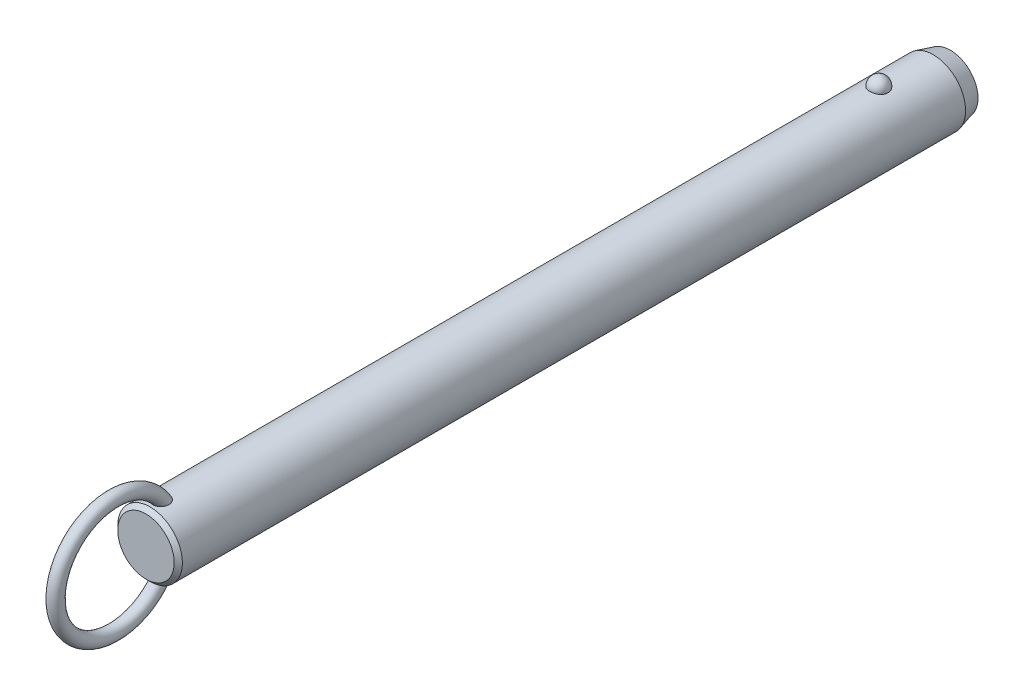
ISO-10303-21;
HEADER;
FILE_DESCRIPTION(('STEP AP214'),'2;1');
FILE_NAME('part.step','',(''),(''),'','','');
FILE_SCHEMA(('AUTOMOTIVE_DESIGN { 1 0 10303 214 1 1 1 1 }'));
ENDSEC;
DATA;
#1=APPLICATION_CONTEXT('core data for automotive mechanical design processes');
#2=APPLICATION_PROTOCOL_DEFINITION('international standard','automotive_design',2000,#1);
#3=PRODUCT_CONTEXT('',#1,'mechanical');
#4=PRODUCT('Part','Part','',(#3));
#5=PRODUCT_RELATED_PRODUCT_CATEGORY('part','',(#4));
#6=PRODUCT_DEFINITION_FORMATION('','',#4);
#7=PRODUCT_DEFINITION_CONTEXT('part definition',#1,'design');
#8=PRODUCT_DEFINITION('design','',#6,#7);
#9=PRODUCT_DEFINITION_SHAPE('','',#8);
#10=(LENGTH_UNIT() NAMED_UNIT(*) SI_UNIT(.MILLI.,.METRE.));
#11=(NAMED_UNIT(*) PLANE_ANGLE_UNIT() SI_UNIT($,.RADIAN.));
#12=(NAMED_UNIT(*) SI_UNIT($,.STERADIAN.) SOLID_ANGLE_UNIT());
#13=UNCERTAINTY_MEASURE_WITH_UNIT(LENGTH_MEASURE(1.E-05),#10,'distance_accuracy_value','');
#14=(GEOMETRIC_REPRESENTATION_CONTEXT(3) GLOBAL_UNCERTAINTY_ASSIGNED_CONTEXT((#13)) GLOBAL_UNIT_ASSIGNED_CONTEXT((#10,
#11,#12)) REPRESENTATION_CONTEXT('',''));
#15=CARTESIAN_POINT('',(0.,0.,0.));
#16=DIRECTION('',(0.,0.,1.));
#17=DIRECTION('',(1.,0.,0.));
#18=AXIS2_PLACEMENT_3D('',#15,#16,#17);
#19=CARTESIAN_POINT('',(0.,0.,203.2));
#20=DIRECTION('',(0.,0.,-1.));
#21=DIRECTION('',(-1.,0.,0.));
#22=AXIS2_PLACEMENT_3D('',#19,#20,#21);
#23=CYLINDRICAL_SURFACE('',#22,9.5);
#24=CARTESIAN_POINT('',(2.67259918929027,9.11631578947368,-2.70000000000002));
#25=CARTESIAN_POINT('',(2.6725968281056,9.11631786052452,-2.54909854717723));
#26=CARTESIAN_POINT('',(2.66030567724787,9.11994722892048,-2.39816735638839));
#27=CARTESIAN_POINT('',(2.6114347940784,9.13405924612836,-2.10058568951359));
#28=CARTESIAN_POINT('',(2.57484658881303,9.14454428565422,-1.95393672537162));
#29=CARTESIAN_POINT('',(2.47830875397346,9.17117631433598,-1.66916069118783));
#30=CARTESIAN_POINT('',(2.41836936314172,9.18732082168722,-1.53102991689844));
#31=CARTESIAN_POINT('',(2.27661331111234,9.22346780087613,-1.26705393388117));
#32=CARTESIAN_POINT('',(2.19479699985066,9.24347021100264,-1.14120852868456));
#33=CARTESIAN_POINT('',(2.01085282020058,9.28522401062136,-0.904632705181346));
#34=CARTESIAN_POINT('',(1.90862396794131,9.30698376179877,-0.793982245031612));
#35=CARTESIAN_POINT('',(1.6867437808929,9.34973971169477,-0.591607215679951));
#36=CARTESIAN_POINT('',(1.56709244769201,9.37073591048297,-0.499882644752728));
#37=CARTESIAN_POINT('',(1.31393976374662,9.40956370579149,-0.338167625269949));
#38=CARTESIAN_POINT('',(1.18048026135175,9.42740444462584,-0.268113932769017));
#39=CARTESIAN_POINT('',(0.903154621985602,9.45799906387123,-0.151390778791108));
#40=CARTESIAN_POINT('',(0.759289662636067,9.47075351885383,-0.104718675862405));
#41=CARTESIAN_POINT('',(0.468074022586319,9.48956256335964,-0.0367633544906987));
#42=CARTESIAN_POINT('',(0.320836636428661,9.49573643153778,-0.015027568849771));
#43=CARTESIAN_POINT('',(0.0246714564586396,9.50112183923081,0.00396199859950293));
#44=CARTESIAN_POINT('',(-0.124256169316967,9.50033406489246,0.00121819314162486));
#45=CARTESIAN_POINT('',(-0.417264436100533,9.4919475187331,-0.0284441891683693));
#46=CARTESIAN_POINT('',(-0.561384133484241,9.48444885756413,-0.0550074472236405));
#47=CARTESIAN_POINT('',(-0.842986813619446,9.46357853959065,-0.131064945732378));
#48=CARTESIAN_POINT('',(-0.98046968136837,9.450206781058,-0.180559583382));
#49=CARTESIAN_POINT('',(-1.24585005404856,9.41890822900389,-0.301476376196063));
#50=CARTESIAN_POINT('',(-1.37368611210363,9.40095498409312,-0.373026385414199));
#51=CARTESIAN_POINT('',(-1.61552738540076,9.3624296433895,-0.536025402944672));
#52=CARTESIAN_POINT('',(-1.72953116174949,9.34185727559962,-0.627476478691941));
#53=CARTESIAN_POINT('',(-1.9429225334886,9.29984568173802,-0.829844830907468));
#54=CARTESIAN_POINT('',(-2.04198021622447,9.27839736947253,-0.941108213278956));
#55=CARTESIAN_POINT('',(-2.2202646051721,9.23735994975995,-1.17883414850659));
#56=CARTESIAN_POINT('',(-2.29948985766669,9.21777097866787,-1.30529781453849));
#57=CARTESIAN_POINT('',(-2.43697287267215,9.18238994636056,-1.57158566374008));
#58=CARTESIAN_POINT('',(-2.49497068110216,9.16664569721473,-1.71155057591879));
#59=CARTESIAN_POINT('',(-2.5872073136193,9.14104303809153,-1.99961197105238));
#60=CARTESIAN_POINT('',(-2.62144683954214,9.13118445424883,-2.1477082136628));
#61=CARTESIAN_POINT('',(-2.66521466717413,9.11850622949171,-2.44715424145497));
#62=CARTESIAN_POINT('',(-2.67484831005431,9.11565658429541,-2.59848735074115));
#63=CARTESIAN_POINT('',(-2.66946735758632,9.11723375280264,-2.90067317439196));
#64=CARTESIAN_POINT('',(-2.65445345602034,9.12166036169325,-3.05152590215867));
#65=CARTESIAN_POINT('',(-2.6002971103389,9.13724422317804,-3.34766110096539));
#66=CARTESIAN_POINT('',(-2.56127978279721,9.14836656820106,-3.49296833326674));
#67=CARTESIAN_POINT('',(-2.46018844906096,9.17606676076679,-3.77477535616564));
#68=CARTESIAN_POINT('',(-2.39811349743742,9.19264483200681,-3.91127478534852));
#69=CARTESIAN_POINT('',(-2.25202303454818,9.22952198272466,-4.17244273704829));
#70=CARTESIAN_POINT('',(-2.16788714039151,9.24984129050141,-4.29704106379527));
#71=CARTESIAN_POINT('',(-1.9799408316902,9.29188255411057,-4.53013066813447));
#72=CARTESIAN_POINT('',(-1.87612963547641,9.31360456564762,-4.63862130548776));
#73=CARTESIAN_POINT('',(-1.65105429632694,9.35612959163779,-4.83690299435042));
#74=CARTESIAN_POINT('',(-1.52972405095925,9.37692871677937,-4.9266199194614));
#75=CARTESIAN_POINT('',(-1.27318250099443,9.41518970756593,-5.08429106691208));
#76=CARTESIAN_POINT('',(-1.13797219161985,9.432651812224,-5.15224684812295));
#77=CARTESIAN_POINT('',(-0.859280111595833,9.46208255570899,-5.26371827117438));
#78=CARTESIAN_POINT('',(-0.715925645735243,9.47411833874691,-5.30753421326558));
#79=CARTESIAN_POINT('',(-0.423550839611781,9.4916822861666,-5.37076321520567));
#80=CARTESIAN_POINT('',(-0.274531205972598,9.49721125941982,-5.39017930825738));
#81=CARTESIAN_POINT('',(0.0218446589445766,9.50110860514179,-5.40390587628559));
#82=CARTESIAN_POINT('',(0.169177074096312,9.49961381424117,-5.39869609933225));
#83=CARTESIAN_POINT('',(0.460808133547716,9.48993906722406,-5.36441955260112));
#84=CARTESIAN_POINT('',(0.605106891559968,9.48175936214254,-5.33535367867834));
#85=CARTESIAN_POINT('',(0.886027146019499,9.4596376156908,-5.25435587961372));
#86=CARTESIAN_POINT('',(1.02267710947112,9.44571881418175,-5.20251612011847));
#87=CARTESIAN_POINT('',(1.28523827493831,9.41358993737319,-5.07741549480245));
#88=CARTESIAN_POINT('',(1.41114877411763,9.39537958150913,-5.00415322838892));
#89=CARTESIAN_POINT('',(1.65085227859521,9.3562644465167,-4.83684599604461));
#90=CARTESIAN_POINT('',(1.76442346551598,9.33532178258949,-4.74249218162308));
#91=CARTESIAN_POINT('',(1.97425672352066,9.29321198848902,-4.53620389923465));
#92=CARTESIAN_POINT('',(2.07051582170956,9.27204482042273,-4.42426641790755));
#93=CARTESIAN_POINT('',(2.24490086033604,9.23139221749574,-4.18363183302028));
#94=CARTESIAN_POINT('',(2.32267019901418,9.21194380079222,-4.05466990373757));
#95=CARTESIAN_POINT('',(2.45584092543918,9.1773419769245,-3.78517836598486));
#96=CARTESIAN_POINT('',(2.51124979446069,9.16218713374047,-3.644652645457));
#97=CARTESIAN_POINT('',(2.59380876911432,9.13913522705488,-3.37104301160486));
#98=CARTESIAN_POINT('',(2.62330266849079,9.13064624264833,-3.23871053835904));
#99=CARTESIAN_POINT('',(2.66269870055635,9.11923566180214,-2.97092664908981));
#100=CARTESIAN_POINT('',(2.67260130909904,9.11631393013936,-2.83547530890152));
#101=CARTESIAN_POINT('',(2.67259918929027,9.11631578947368,-2.70000000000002));
#102=B_SPLINE_CURVE_WITH_KNOTS('',3,(#24,#25,#26,#27,#28,#29,#30,#31,#32,#33,#34,#35,#36,#37,
#38,#39,#40,#41,#42,#43,#44,#45,#46,#47,#48,#49,#50,#51,#52,#53,#54,#55,#56,#57,#58,#59,#60,#61,
#62,#63,#64,#65,#66,#67,#68,#69,#70,#71,#72,#73,#74,#75,#76,#77,#78,#79,#80,#81,#82,#83,#84,#85,
#86,#87,#88,#89,#90,#91,#92,#93,#94,#95,#96,#97,#98,#99,#100,#101),.UNSPECIFIED.,.T.,.F.,(4,2,2,
2,2,2,2,2,2,2,2,2,2,2,2,2,2,2,2,2,2,2,2,2,2,2,2,2,2,2,2,2,2,2,2,2,2,2,4),(0.,0.452217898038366,
0.904593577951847,1.35677112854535,1.80894144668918,2.26340676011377,2.71787203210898,
3.17099820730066,3.62407318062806,4.0687883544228,4.51345969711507,4.95160616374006,
5.38976021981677,5.83050358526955,6.27129275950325,6.72071308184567,7.17016633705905,
7.62495278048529,8.07972578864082,8.53254856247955,8.98535859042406,9.43582813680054,
9.88631615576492,10.3393155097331,10.7923328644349,11.2471065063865,11.7018475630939,
12.1507959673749,12.5996885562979,13.0398725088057,13.4800399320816,13.9184421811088,
14.3568730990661,14.802202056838,15.2476074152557,15.7010097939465,16.1542603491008,
16.5602594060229,16.9662486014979),.UNSPECIFIED.);
#103=CARTESIAN_POINT('',(2.67259918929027,9.11631578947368,-2.70000000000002));
#104=VERTEX_POINT('',#103);
#105=EDGE_CURVE('E41',#104,#104,#102,.T.);
#106=ORIENTED_EDGE('',*,*,#105,.T.);
#107=EDGE_LOOP('',(#106));
#108=FACE_BOUND('',#107,.T.);
#109=CARTESIAN_POINT('',(0.,0.,211.52));
#110=DIRECTION('',(0.,0.,1.));
#111=DIRECTION('',(1.,0.,0.));
#112=AXIS2_PLACEMENT_3D('',#109,#110,#111);
#113=CIRCLE('',#112,9.5);
#114=CARTESIAN_POINT('',(9.5,0.,211.52));
#115=VERTEX_POINT('',#114);
#116=EDGE_CURVE('E10',#115,#115,#113,.F.);
#117=ORIENTED_EDGE('',*,*,#116,.T.);
#118=EDGE_LOOP('',(#117));
#119=FACE_BOUND('',#118,.T.);
#120=CARTESIAN_POINT('',(-0.697062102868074,-9.47439269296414,205.867808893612));
#121=CARTESIAN_POINT('',(-0.799579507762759,-9.46685146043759,205.907482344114));
#122=CARTESIAN_POINT('',(-0.898575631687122,-9.45788043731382,205.9559309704));
#123=CARTESIAN_POINT('',(-1.08670047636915,-9.43811593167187,206.068868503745));
#124=CARTESIAN_POINT('',(-1.17583204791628,-9.42732297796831,206.133352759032));
#125=CARTESIAN_POINT('',(-1.34179806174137,-9.40513672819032,206.276209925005));
#126=CARTESIAN_POINT('',(-1.41865133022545,-9.39374438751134,206.354561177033));
#127=CARTESIAN_POINT('',(-1.5586004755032,-9.37154196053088,206.522752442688));
#128=CARTESIAN_POINT('',(-1.62169476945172,-9.3607319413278,206.61259377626));
#129=CARTESIAN_POINT('',(-1.73527695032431,-9.34035749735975,206.804500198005));
#130=CARTESIAN_POINT('',(-1.78522266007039,-9.33085270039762,206.906891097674));
#131=CARTESIAN_POINT('',(-1.86924997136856,-9.3143834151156,207.118148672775));
#132=CARTESIAN_POINT('',(-1.90332570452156,-9.30741986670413,207.227017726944));
#133=CARTESIAN_POINT('',(-1.95893603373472,-9.29588482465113,207.460473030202));
#134=CARTESIAN_POINT('',(-1.97872420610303,-9.29165182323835,207.585489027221));
#135=CARTESIAN_POINT('',(-2.00062129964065,-9.28695978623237,207.837080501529));
#136=CARTESIAN_POINT('',(-2.00272284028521,-9.28650232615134,207.963656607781));
#137=CARTESIAN_POINT('',(-1.98958876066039,-9.28932750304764,208.236815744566));
#138=CARTESIAN_POINT('',(-1.97143366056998,-9.2932400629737,208.383251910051));
#139=CARTESIAN_POINT('',(-1.91479925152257,-9.30507151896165,208.672062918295));
#140=CARTESIAN_POINT('',(-1.87629122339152,-9.31299607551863,208.814431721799));
#141=CARTESIAN_POINT('',(-1.77225683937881,-9.33340232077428,209.115172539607));
#142=CARTESIAN_POINT('',(-1.70334898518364,-9.34641636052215,209.272369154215));
#143=CARTESIAN_POINT('',(-1.58111062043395,-9.36759153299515,209.497517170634));
#144=CARTESIAN_POINT('',(-1.53721459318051,-9.37492619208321,209.570796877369));
#145=CARTESIAN_POINT('',(-1.44302631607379,-9.38988566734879,209.71307405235));
#146=CARTESIAN_POINT('',(-1.39273721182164,-9.39751033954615,209.782073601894));
#147=CARTESIAN_POINT('',(-1.26775962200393,-9.41530678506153,209.936983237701));
#148=CARTESIAN_POINT('',(-1.19052326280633,-9.42548108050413,210.020871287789));
#149=CARTESIAN_POINT('',(-1.02420241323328,-9.44499825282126,210.176008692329));
#150=CARTESIAN_POINT('',(-0.935139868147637,-9.45434261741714,210.247280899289));
#151=CARTESIAN_POINT('',(-0.766610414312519,-9.46930670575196,210.358695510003));
#152=CARTESIAN_POINT('',(-0.689439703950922,-9.47529223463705,210.402235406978));
#153=CARTESIAN_POINT('',(-0.528942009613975,-9.48560294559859,210.47631336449));
#154=CARTESIAN_POINT('',(-0.445620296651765,-9.48992953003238,210.506862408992));
#155=CARTESIAN_POINT('',(-0.273901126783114,-9.49644161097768,210.552579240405));
#156=CARTESIAN_POINT('',(-0.18546574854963,-9.49860811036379,210.56761059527));
#157=CARTESIAN_POINT('',(-0.00734541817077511,-9.5004135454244,210.580149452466));
#158=CARTESIAN_POINT('',(0.0823387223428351,-9.50005405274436,210.577667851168));
#159=CARTESIAN_POINT('',(0.247679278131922,-9.49708301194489,210.556995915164));
#160=CARTESIAN_POINT('',(0.323620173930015,-9.49477609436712,210.540930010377));
#161=CARTESIAN_POINT('',(0.471981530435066,-9.48855917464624,210.497172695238));
#162=CARTESIAN_POINT('',(0.544400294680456,-9.48464840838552,210.469475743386));
#163=CARTESIAN_POINT('',(0.708947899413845,-9.47398336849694,210.39280266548));
#164=CARTESIAN_POINT('',(0.79914966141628,-9.46671310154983,210.339774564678));
#165=CARTESIAN_POINT('',(0.969783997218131,-9.4507622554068,210.219973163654));
#166=CARTESIAN_POINT('',(1.05019415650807,-9.44207854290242,210.153169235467));
#167=CARTESIAN_POINT('',(1.23092343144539,-9.42051459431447,209.980759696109));
#168=CARTESIAN_POINT('',(1.32652499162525,-9.40733378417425,209.87026193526));
#169=CARTESIAN_POINT('',(1.49893121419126,-9.3814074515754,209.635561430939));
#170=CARTESIAN_POINT('',(1.5757161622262,-9.36866239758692,209.511344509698));
#171=CARTESIAN_POINT('',(1.71285426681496,-9.34457644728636,209.249389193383));
#172=CARTESIAN_POINT('',(1.77266365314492,-9.33328726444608,209.11136233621));
#173=CARTESIAN_POINT('',(1.87239208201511,-9.31379209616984,208.828051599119));
#174=CARTESIAN_POINT('',(1.91230158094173,-9.30558759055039,208.682764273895));
#175=CARTESIAN_POINT('',(1.97604189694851,-9.29228394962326,208.362028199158));
#176=CARTESIAN_POINT('',(1.99587438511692,-9.28797202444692,208.185724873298));
#177=CARTESIAN_POINT('',(2.0029570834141,-9.28645519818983,207.832414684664));
#178=CARTESIAN_POINT('',(1.99025930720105,-9.28923895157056,207.655409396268));
#179=CARTESIAN_POINT('',(1.93735479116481,-9.30038134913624,207.356338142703));
#180=CARTESIAN_POINT('',(1.90576827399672,-9.30697680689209,207.232667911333));
#181=CARTESIAN_POINT('',(1.82287484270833,-9.32356855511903,206.992329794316));
#182=CARTESIAN_POINT('',(1.77158213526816,-9.33356239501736,206.875656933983));
#183=CARTESIAN_POINT('',(1.64885744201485,-9.35602275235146,206.652706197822));
#184=CARTESIAN_POINT('',(1.57730995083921,-9.36850332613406,206.546492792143));
#185=CARTESIAN_POINT('',(1.41543264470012,-9.39431873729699,206.349553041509));
#186=CARTESIAN_POINT('',(1.32510883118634,-9.40765330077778,206.258821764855));
#187=CARTESIAN_POINT('',(1.13846223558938,-9.43195720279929,206.105033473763));
#188=CARTESIAN_POINT('',(1.04369890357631,-9.4430289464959,206.040094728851));
#189=CARTESIAN_POINT('',(0.843965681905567,-9.46296805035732,205.928038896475));
#190=CARTESIAN_POINT('',(0.739000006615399,-9.4718363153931,205.880914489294));
#191=CARTESIAN_POINT('',(0.52817529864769,-9.48586140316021,205.808117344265));
#192=CARTESIAN_POINT('',(0.422686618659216,-9.49119633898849,205.78140249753));
#193=CARTESIAN_POINT('',(0.208590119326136,-9.49831365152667,205.746013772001));
#194=CARTESIAN_POINT('',(0.0999817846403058,-9.500095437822,205.737342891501));
#195=CARTESIAN_POINT('',(-0.126104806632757,-9.49988861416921,205.738350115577));
#196=CARTESIAN_POINT('',(-0.243578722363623,-9.49757821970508,205.749594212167));
#197=CARTESIAN_POINT('',(-0.474390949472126,-9.48885165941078,205.793167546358));
#198=CARTESIAN_POINT('',(-0.587729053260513,-9.48243528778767,205.825497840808));
#199=CARTESIAN_POINT('',(-0.697062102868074,-9.47439269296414,205.867808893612));
#200=B_SPLINE_CURVE_WITH_KNOTS('',3,(#120,#121,#122,#123,#124,#125,#126,#127,#128,#129,#130,
#131,#132,#133,#134,#135,#136,#137,#138,#139,#140,#141,#142,#143,#144,#145,#146,#147,#148,#149,
#150,#151,#152,#153,#154,#155,#156,#157,#158,#159,#160,#161,#162,#163,#164,#165,#166,#167,#168,
#169,#170,#171,#172,#173,#174,#175,#176,#177,#178,#179,#180,#181,#182,#183,#184,#185,#186,#187,
#188,#189,#190,#191,#192,#193,#194,#195,#196,#197,#198,#199),.UNSPECIFIED.,.T.,.F.,(4,2,2,2,2,2,
2,2,2,2,2,2,2,2,2,2,2,2,2,2,2,2,2,2,2,2,2,2,2,2,2,2,2,2,2,2,2,2,2,4),(0.,0.330119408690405,
0.660143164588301,0.989655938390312,1.31920659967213,1.66074728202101,2.00241415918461,
2.38088696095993,2.75951768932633,3.20065679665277,3.64242004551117,4.15620996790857,
4.41314162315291,4.66994734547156,5.01228664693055,5.35399933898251,5.61943037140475,
5.884636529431,6.15215502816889,6.41950709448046,6.65144391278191,6.88349136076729,
7.19641200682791,7.51003602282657,7.94779711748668,8.3860149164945,8.83699707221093,
9.28819530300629,9.81778662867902,10.3465317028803,10.7284172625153,11.1100280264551,
11.4938603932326,11.8775702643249,12.2220189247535,12.5663259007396,12.8915939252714,
13.2169159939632,13.5689650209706,13.9210316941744),.UNSPECIFIED.);
#201=CARTESIAN_POINT('',(-0.697062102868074,-9.47439269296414,205.867808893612));
#202=VERTEX_POINT('',#201);
#203=EDGE_CURVE('E60',#202,#202,#200,.T.);
#204=ORIENTED_EDGE('',*,*,#203,.T.);
#205=EDGE_LOOP('',(#204));
#206=FACE_BOUND('',#205,.T.);
#207=CARTESIAN_POINT('',(-0.697062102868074,9.47439269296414,205.867808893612));
#208=CARTESIAN_POINT('',(-0.597792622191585,9.48169483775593,205.82939564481));
#209=CARTESIAN_POINT('',(-0.495106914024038,9.48766580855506,205.799168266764));
#210=CARTESIAN_POINT('',(-0.285876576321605,9.49627648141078,205.756032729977));
#211=CARTESIAN_POINT('',(-0.179324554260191,9.49890941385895,205.743159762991));
#212=CARTESIAN_POINT('',(0.0344157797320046,9.50053798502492,205.735166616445));
#213=CARTESIAN_POINT('',(0.141603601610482,9.49953613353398,205.740034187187));
#214=CARTESIAN_POINT('',(0.353563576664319,9.49401038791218,205.767365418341));
#215=CARTESIAN_POINT('',(0.458336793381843,9.48948807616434,205.78982117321));
#216=CARTESIAN_POINT('',(0.66249373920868,9.4774236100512,205.851671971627));
#217=CARTESIAN_POINT('',(0.761881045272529,9.46988348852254,205.891055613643));
#218=CARTESIAN_POINT('',(0.95260839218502,9.45260382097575,205.985634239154));
#219=CARTESIAN_POINT('',(1.04394806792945,9.44286417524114,206.040829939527));
#220=CARTESIAN_POINT('',(1.21712767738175,9.42211760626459,206.166066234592));
#221=CARTESIAN_POINT('',(1.29885671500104,9.41109835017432,206.236257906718));
#222=CARTESIAN_POINT('',(1.44978975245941,9.38903310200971,206.388980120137));
#223=CARTESIAN_POINT('',(1.51899278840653,9.37798710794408,206.471511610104));
#224=CARTESIAN_POINT('',(1.64602857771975,9.35654375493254,206.649776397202));
#225=CARTESIAN_POINT('',(1.70333052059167,9.34618688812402,206.745891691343));
#226=CARTESIAN_POINT('',(1.80259341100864,9.32755128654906,206.945897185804));
#227=CARTESIAN_POINT('',(1.84454942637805,9.31927322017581,207.049789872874));
#228=CARTESIAN_POINT('',(1.91637039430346,9.30478365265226,207.272213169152));
#229=CARTESIAN_POINT('',(1.944805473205,9.29882552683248,207.391219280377));
#230=CARTESIAN_POINT('',(1.98449865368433,9.29043398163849,207.632143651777));
#231=CARTESIAN_POINT('',(1.99574908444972,9.28800213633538,207.754063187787));
#232=CARTESIAN_POINT('',(2.00275141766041,9.28649645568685,208.016932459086));
#233=CARTESIAN_POINT('',(1.99588238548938,9.28799035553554,208.157952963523));
#234=CARTESIAN_POINT('',(1.96270559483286,9.29505517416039,208.437621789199));
#235=CARTESIAN_POINT('',(1.93637872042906,9.30063010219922,208.576267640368));
#236=CARTESIAN_POINT('',(1.85949176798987,9.31633564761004,208.872561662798));
#237=CARTESIAN_POINT('',(1.80549792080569,9.3270926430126,209.029290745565));
#238=CARTESIAN_POINT('',(1.67376869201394,9.3516306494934,209.332284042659));
#239=CARTESIAN_POINT('',(1.59603181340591,9.36541185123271,209.478547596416));
#240=CARTESIAN_POINT('',(1.4360277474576,9.39110706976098,209.725813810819));
#241=CARTESIAN_POINT('',(1.35831795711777,9.40278656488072,209.829791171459));
#242=CARTESIAN_POINT('',(1.18774483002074,9.42585025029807,210.024534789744));
#243=CARTESIAN_POINT('',(1.09490932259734,9.43723493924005,210.115324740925));
#244=CARTESIAN_POINT('',(0.921110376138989,9.45552616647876,210.25620334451));
#245=CARTESIAN_POINT('',(0.843738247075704,9.46281058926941,210.310656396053));
#246=CARTESIAN_POINT('',(0.681245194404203,9.47589120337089,210.406711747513));
#247=CARTESIAN_POINT('',(0.596135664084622,9.48168953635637,210.448332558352));
#248=CARTESIAN_POINT('',(0.433779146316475,9.49038144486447,210.510089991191));
#249=CARTESIAN_POINT('',(0.357459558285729,9.49359170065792,210.53260136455));
#250=CARTESIAN_POINT('',(0.202074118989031,9.49816761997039,210.564574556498));
#251=CARTESIAN_POINT('',(0.12301025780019,9.49953459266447,210.574045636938));
#252=CARTESIAN_POINT('',(-0.0357372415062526,9.50026497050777,210.579114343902));
#253=CARTESIAN_POINT('',(-0.11542180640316,9.49962433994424,210.574684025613));
#254=CARTESIAN_POINT('',(-0.27282370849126,9.49640854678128,210.552296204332));
#255=CARTESIAN_POINT('',(-0.350540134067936,9.4938325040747,210.534332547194));
#256=CARTESIAN_POINT('',(-0.500580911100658,9.4870946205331,210.486802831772));
#257=CARTESIAN_POINT('',(-0.57297929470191,9.48296359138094,210.457461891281));
#258=CARTESIAN_POINT('',(-0.712864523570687,9.47347609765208,210.389008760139));
#259=CARTESIAN_POINT('',(-0.780349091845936,9.4681190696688,210.349892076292));
#260=CARTESIAN_POINT('',(-0.94630921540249,9.45329720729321,210.239432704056));
#261=CARTESIAN_POINT('',(-1.04090230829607,9.44321512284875,210.162329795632));
#262=CARTESIAN_POINT('',(-1.21661929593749,9.42219227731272,209.99409718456));
#263=CARTESIAN_POINT('',(-1.29770519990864,9.41124921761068,209.902929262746));
#264=CARTESIAN_POINT('',(-1.47319646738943,9.38563439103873,209.676162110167));
#265=CARTESIAN_POINT('',(-1.56208878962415,9.37102009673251,209.536289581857));
#266=CARTESIAN_POINT('',(-1.71623987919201,9.34401559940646,209.243950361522));
#267=CARTESIAN_POINT('',(-1.78147866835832,9.33162728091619,209.091473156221));
#268=CARTESIAN_POINT('',(-1.88853837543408,9.31055541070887,208.775647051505));
#269=CARTESIAN_POINT('',(-1.92998995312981,9.30193076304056,208.612168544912));
#270=CARTESIAN_POINT('',(-1.98590726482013,9.29015757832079,208.280526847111));
#271=CARTESIAN_POINT('',(-2.00040705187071,9.2870021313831,208.112369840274));
#272=CARTESIAN_POINT('',(-1.99964701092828,9.28716218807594,207.805080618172));
#273=CARTESIAN_POINT('',(-1.98908145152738,9.28945704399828,207.665936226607));
#274=CARTESIAN_POINT('',(-1.94566294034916,9.29865169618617,207.391153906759));
#275=CARTESIAN_POINT('',(-1.91282062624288,9.30554929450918,207.255514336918));
#276=CARTESIAN_POINT('',(-1.84582133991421,9.31898248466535,207.057802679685));
#277=CARTESIAN_POINT('',(-1.8203808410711,9.32400364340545,206.992583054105));
#278=CARTESIAN_POINT('',(-1.7635051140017,9.33492884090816,206.864903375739));
#279=CARTESIAN_POINT('',(-1.7320730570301,9.34083241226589,206.802441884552));
#280=CARTESIAN_POINT('',(-1.66324243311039,9.353333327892,206.68094078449));
#281=CARTESIAN_POINT('',(-1.62584239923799,9.35993084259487,206.621902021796));
#282=CARTESIAN_POINT('',(-1.54527678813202,9.37356864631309,206.507987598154));
#283=CARTESIAN_POINT('',(-1.50211241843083,9.38060884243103,206.453111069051));
#284=CARTESIAN_POINT('',(-1.37681147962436,9.40004442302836,206.309961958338));
#285=CARTESIAN_POINT('',(-1.28916358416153,9.41261047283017,206.226429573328));
#286=CARTESIAN_POINT('',(-1.09996826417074,9.43658180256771,206.077236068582));
#287=CARTESIAN_POINT('',(-0.998461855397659,9.44799034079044,206.011523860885));
#288=CARTESIAN_POINT('',(-0.860188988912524,9.46103017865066,205.9394367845));
#289=CARTESIAN_POINT('',(-0.82814120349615,9.46389141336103,205.923851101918));
#290=CARTESIAN_POINT('',(-0.763210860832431,9.46934915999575,205.894473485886));
#291=CARTESIAN_POINT('',(-0.730328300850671,9.47194567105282,205.880681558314));
#292=CARTESIAN_POINT('',(-0.697062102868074,9.47439269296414,205.867808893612));
#293=B_SPLINE_CURVE_WITH_KNOTS('',3,(#207,#208,#209,#210,#211,#212,#213,#214,#215,#216,#217,
#218,#219,#220,#221,#222,#223,#224,#225,#226,#227,#228,#229,#230,#231,#232,#233,#234,#235,#236,
#237,#238,#239,#240,#241,#242,#243,#244,#245,#246,#247,#248,#249,#250,#251,#252,#253,#254,#255,
#256,#257,#258,#259,#260,#261,#262,#263,#264,#265,#266,#267,#268,#269,#270,#271,#272,#273,#274,
#275,#276,#277,#278,#279,#280,#281,#282,#283,#284,#285,#286,#287,#288,#289,#290,#291,#292),
.UNSPECIFIED.,.T.,.F.,(4,2,2,2,2,2,2,2,2,2,2,2,2,2,2,2,2,2,2,2,2,2,2,2,2,2,2,2,2,2,2,2,2,2,2,2,
2,2,2,2,2,2,4),(0.,0.31994216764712,0.640532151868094,0.96090081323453,1.28112555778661,
1.60113495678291,1.92115886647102,2.24457323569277,2.56801248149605,2.90371927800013,
3.23953387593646,3.60560313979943,3.97183576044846,4.39383693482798,4.81625324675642,
5.31257045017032,5.80891895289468,6.19868344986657,6.58773876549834,6.87145417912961,
7.15475838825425,7.39263751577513,7.63034760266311,7.86853584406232,8.10683246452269,
8.34063661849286,8.57454843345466,8.9398393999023,9.30614105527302,9.80266668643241,
10.299610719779,10.8040753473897,11.3079021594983,11.7249776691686,12.1418541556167,
12.3521485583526,12.562331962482,12.7725671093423,12.9827582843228,13.3458276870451,
13.7078449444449,13.8150604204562,13.9222762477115),.UNSPECIFIED.);
#294=CARTESIAN_POINT('',(-0.697062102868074,9.47439269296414,205.867808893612));
#295=VERTEX_POINT('',#294);
#296=EDGE_CURVE('E67',#295,#295,#293,.T.);
#297=ORIENTED_EDGE('',*,*,#296,.T.);
#298=EDGE_LOOP('',(#297));
#299=FACE_BOUND('',#298,.T.);
#300=CARTESIAN_POINT('',(0.,0.,-18.6999999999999));
#301=DIRECTION('',(0.,0.,-1.));
#302=DIRECTION('',(-1.,0.,0.));
#303=AXIS2_PLACEMENT_3D('',#300,#301,#302);
#304=CIRCLE('',#303,9.5);
#305=CARTESIAN_POINT('',(-9.5,0.,-18.6999999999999));
#306=VERTEX_POINT('',#305);
#307=EDGE_CURVE('E57',#306,#306,#304,.F.);
#308=ORIENTED_EDGE('',*,*,#307,.T.);
#309=EDGE_LOOP('',(#308));
#310=FACE_BOUND('',#309,.T.);
#311=ADVANCED_FACE('F37',(#108,#119,#206,#299,#310),#23,.T.);
#312=CARTESIAN_POINT('',(0.,0.,-23.7));
#313=DIRECTION('',(0.,0.,-1.));
#314=DIRECTION('',(-1.,0.,0.));
#315=AXIS2_PLACEMENT_3D('',#312,#313,#314);
#316=PLANE('',#315);
#317=CARTESIAN_POINT('',(0.,0.,-23.7));
#318=DIRECTION('',(0.,0.,-1.));
#319=DIRECTION('',(-1.,0.,0.));
#320=AXIS2_PLACEMENT_3D('',#317,#318,#319);
#321=CIRCLE('',#320,8.16025403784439);
#322=CARTESIAN_POINT('',(-8.16025403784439,0.,-23.7));
#323=VERTEX_POINT('',#322);
#324=EDGE_CURVE('E66',#323,#323,#321,.T.);
#325=ORIENTED_EDGE('',*,*,#324,.T.);
#326=EDGE_LOOP('',(#325));
#327=FACE_BOUND('',#326,.T.);
#328=ADVANCED_FACE('F85',(#327),#316,.T.);
#329=CARTESIAN_POINT('',(0.,0.,-23.7));
#330=DIRECTION('',(0.,0.,1.));
#331=DIRECTION('',(1.,0.,0.));
#332=AXIS2_PLACEMENT_3D('',#329,#330,#331);
#333=CONICAL_SURFACE('',#332,8.16025403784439,0.261799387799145);
#334=ORIENTED_EDGE('',*,*,#307,.F.);
#335=EDGE_LOOP('',(#334));
#336=FACE_BOUND('',#335,.T.);
#337=ORIENTED_EDGE('',*,*,#324,.F.);
#338=EDGE_LOOP('',(#337));
#339=FACE_BOUND('',#338,.T.);
#340=ADVANCED_FACE('F83',(#336,#339),#333,.T.);
#341=CARTESIAN_POINT('',(0.,0.,212.72));
#342=DIRECTION('',(0.,0.,1.));
#343=DIRECTION('',(1.,0.,0.));
#344=AXIS2_PLACEMENT_3D('',#341,#342,#343);
#345=PLANE('',#344);
#346=CARTESIAN_POINT('',(0.,0.,212.72));
#347=DIRECTION('',(0.,0.,1.));
#348=DIRECTION('',(1.,0.,0.));
#349=AXIS2_PLACEMENT_3D('',#346,#347,#348);
#350=CIRCLE('',#349,8.30000000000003);
#351=CARTESIAN_POINT('',(8.30000000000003,0.,212.72));
#352=VERTEX_POINT('',#351);
#353=EDGE_CURVE('E50',#352,#352,#350,.T.);
#354=ORIENTED_EDGE('',*,*,#353,.T.);
#355=EDGE_LOOP('',(#354));
#356=FACE_BOUND('',#355,.T.);
#357=ADVANCED_FACE('F77',(#356),#345,.T.);
#358=CARTESIAN_POINT('',(0.,0.,222.25));
#359=DIRECTION('',(1.,0.,0.));
#360=DIRECTION('',(0.,0.,-1.));
#361=AXIS2_PLACEMENT_3D('',#358,#359,#360);
#362=TOROIDAL_SURFACE('',#361,17.05,2.);
#363=ORIENTED_EDGE('',*,*,#296,.F.);
#364=EDGE_LOOP('',(#363));
#365=FACE_BOUND('',#364,.T.);
#366=ORIENTED_EDGE('',*,*,#203,.F.);
#367=EDGE_LOOP('',(#366));
#368=FACE_BOUND('',#367,.T.);
#369=ADVANCED_FACE('F73',(#365,#368),#362,.T.);
#370=CARTESIAN_POINT('',(0.,0.,212.72));
#371=DIRECTION('',(0.,0.,-1.));
#372=DIRECTION('',(-1.,0.,0.));
#373=AXIS2_PLACEMENT_3D('',#370,#371,#372);
#374=CONICAL_SURFACE('',#373,8.30000000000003,0.785398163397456);
#375=ORIENTED_EDGE('',*,*,#116,.F.);
#376=EDGE_LOOP('',(#375));
#377=FACE_BOUND('',#376,.T.);
#378=ORIENTED_EDGE('',*,*,#353,.F.);
#379=EDGE_LOOP('',(#378));
#380=FACE_BOUND('',#379,.T.);
#381=ADVANCED_FACE('F39',(#377,#380),#374,.T.);
#382=CARTESIAN_POINT('',(0.,9.5,-2.70000000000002));
#383=DIRECTION('',(0.,1.,0.));
#384=DIRECTION('',(0.,0.,1.));
#385=AXIS2_PLACEMENT_3D('',#382,#383,#384);
#386=SPHERICAL_SURFACE('',#385,2.7);
#387=ORIENTED_EDGE('',*,*,#105,.F.);
#388=EDGE_LOOP('',(#387));
#389=FACE_BOUND('',#388,.T.);
#390=ADVANCED_FACE('F79',(#389),#386,.T.);
#391=CLOSED_SHELL('',(#311,#328,#340,#357,#369,#381,#390));
#392=MANIFOLD_SOLID_BREP('B2',#391);
#393=ADVANCED_BREP_SHAPE_REPRESENTATION('',(#18,#392),#14);
#394=SHAPE_DEFINITION_REPRESENTATION(#9,#393);
ENDSEC;
END-ISO-10303-21;
